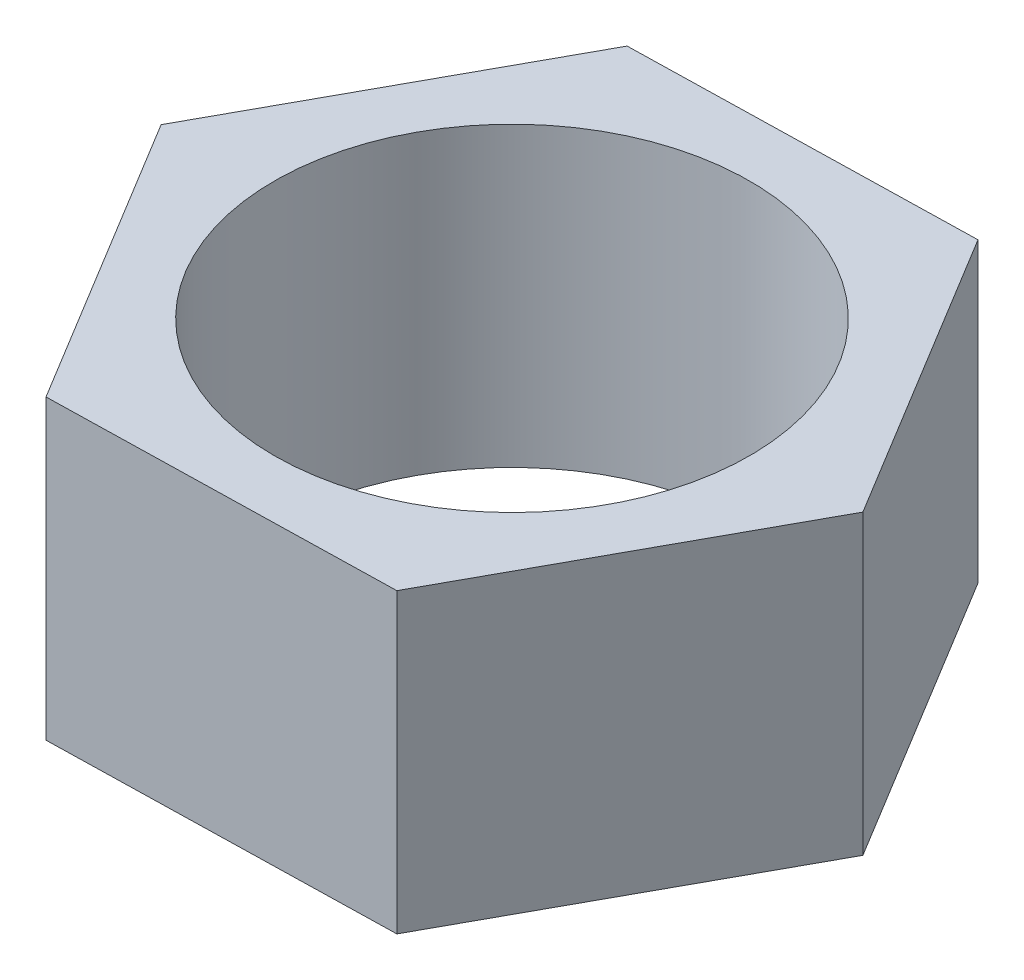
ISO-10303-21;
HEADER;
FILE_DESCRIPTION(('STEP AP214'),'2;1');
FILE_NAME('part.step','',(''),(''),'','','');
FILE_SCHEMA(('AUTOMOTIVE_DESIGN { 1 0 10303 214 1 1 1 1 }'));
ENDSEC;
DATA;
#1=APPLICATION_CONTEXT('core data for automotive mechanical design processes');
#2=APPLICATION_PROTOCOL_DEFINITION('international standard','automotive_design',2000,#1);
#3=PRODUCT_CONTEXT('',#1,'mechanical');
#4=PRODUCT('Part','Part','',(#3));
#5=PRODUCT_RELATED_PRODUCT_CATEGORY('part','',(#4));
#6=PRODUCT_DEFINITION_FORMATION('','',#4);
#7=PRODUCT_DEFINITION_CONTEXT('part definition',#1,'design');
#8=PRODUCT_DEFINITION('design','',#6,#7);
#9=PRODUCT_DEFINITION_SHAPE('','',#8);
#10=(LENGTH_UNIT() NAMED_UNIT(*) SI_UNIT(.MILLI.,.METRE.));
#11=(NAMED_UNIT(*) PLANE_ANGLE_UNIT() SI_UNIT($,.RADIAN.));
#12=(NAMED_UNIT(*) SI_UNIT($,.STERADIAN.) SOLID_ANGLE_UNIT());
#13=UNCERTAINTY_MEASURE_WITH_UNIT(LENGTH_MEASURE(1.E-05),#10,'distance_accuracy_value','');
#14=(GEOMETRIC_REPRESENTATION_CONTEXT(3) GLOBAL_UNCERTAINTY_ASSIGNED_CONTEXT((#13)) GLOBAL_UNIT_ASSIGNED_CONTEXT((#10,
#11,#12)) REPRESENTATION_CONTEXT('',''));
#15=CARTESIAN_POINT('',(0.,0.,0.));
#16=DIRECTION('',(0.,0.,1.));
#17=DIRECTION('',(1.,0.,0.));
#18=AXIS2_PLACEMENT_3D('',#15,#16,#17);
#19=CARTESIAN_POINT('',(-2.77410471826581,5.,5.06336610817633));
#20=DIRECTION('',(-0.0223846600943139,0.,-0.999749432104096));
#21=DIRECTION('',(-0.999749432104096,0.,0.0223846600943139));
#22=AXIS2_PLACEMENT_3D('',#19,#20,#21);
#23=PLANE('',#22);
#24=DIRECTION('',(0.999749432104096,0.,-0.0223846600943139));
#25=VECTOR('',#24,1.);
#26=CARTESIAN_POINT('',(-2.77410471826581,0.,5.06336610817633));
#27=LINE('',#26,#25);
#28=CARTESIAN_POINT('',(-2.77410471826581,0.,5.06336610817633));
#29=VERTEX_POINT('',#28);
#30=CARTESIAN_POINT('',(2.99795131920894,0.,4.93412821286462));
#31=VERTEX_POINT('',#30);
#32=EDGE_CURVE('E118',#29,#31,#27,.T.);
#33=ORIENTED_EDGE('',*,*,#32,.T.);
#34=DIRECTION('',(0.,-1.,0.));
#35=VECTOR('',#34,1.);
#36=CARTESIAN_POINT('',(2.99795131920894,5.,4.93412821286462));
#37=LINE('',#36,#35);
#38=CARTESIAN_POINT('',(2.99795131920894,5.,4.93412821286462));
#39=VERTEX_POINT('',#38);
#40=EDGE_CURVE('E11',#39,#31,#37,.T.);
#41=ORIENTED_EDGE('',*,*,#40,.F.);
#42=DIRECTION('',(0.999749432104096,0.,-0.0223846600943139));
#43=VECTOR('',#42,1.);
#44=CARTESIAN_POINT('',(-2.77410471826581,5.,5.06336610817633));
#45=LINE('',#44,#43);
#46=CARTESIAN_POINT('',(-2.77410471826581,5.,5.06336610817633));
#47=VERTEX_POINT('',#46);
#48=EDGE_CURVE('E128',#47,#39,#45,.T.);
#49=ORIENTED_EDGE('',*,*,#48,.F.);
#50=DIRECTION('',(0.,-1.,0.));
#51=VECTOR('',#50,1.);
#52=CARTESIAN_POINT('',(-2.77410471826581,5.,5.06336610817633));
#53=LINE('',#52,#51);
#54=EDGE_CURVE('E114',#47,#29,#53,.T.);
#55=ORIENTED_EDGE('',*,*,#54,.T.);
#56=EDGE_LOOP('',(#33,#41,#49,#55));
#57=FACE_BOUND('',#56,.T.);
#58=ADVANCED_FACE('F33',(#57),#23,.F.);
#59=CARTESIAN_POINT('',(2.99795131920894,5.,4.93412821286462));
#60=DIRECTION('',(-0.877000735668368,0.,-0.480489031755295));
#61=DIRECTION('',(-0.480489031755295,0.,0.877000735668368));
#62=AXIS2_PLACEMENT_3D('',#59,#60,#61);
#63=PLANE('',#62);
#64=DIRECTION('',(0.480489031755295,0.,-0.877000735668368));
#65=VECTOR('',#64,1.);
#66=CARTESIAN_POINT('',(2.99795131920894,0.,4.93412821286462));
#67=LINE('',#66,#65);
#68=CARTESIAN_POINT('',(5.77205603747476,0.,-0.129237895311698));
#69=VERTEX_POINT('',#68);
#70=EDGE_CURVE('E121',#31,#69,#67,.T.);
#71=ORIENTED_EDGE('',*,*,#70,.T.);
#72=DIRECTION('',(0.,-1.,0.));
#73=VECTOR('',#72,1.);
#74=CARTESIAN_POINT('',(5.77205603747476,5.,-0.129237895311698));
#75=LINE('',#74,#73);
#76=CARTESIAN_POINT('',(5.77205603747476,5.,-0.129237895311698));
#77=VERTEX_POINT('',#76);
#78=EDGE_CURVE('E42',#77,#69,#75,.T.);
#79=ORIENTED_EDGE('',*,*,#78,.F.);
#80=DIRECTION('',(0.480489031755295,0.,-0.877000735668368));
#81=VECTOR('',#80,1.);
#82=CARTESIAN_POINT('',(2.99795131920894,5.,4.93412821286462));
#83=LINE('',#82,#81);
#84=EDGE_CURVE('E87',#39,#77,#83,.T.);
#85=ORIENTED_EDGE('',*,*,#84,.F.);
#86=ORIENTED_EDGE('',*,*,#40,.T.);
#87=EDGE_LOOP('',(#71,#79,#85,#86));
#88=FACE_BOUND('',#87,.T.);
#89=ADVANCED_FACE('F154',(#88),#63,.F.);
#90=CARTESIAN_POINT('',(5.77205603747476,5.,-0.129237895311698));
#91=DIRECTION('',(-0.854616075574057,0.,0.519260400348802));
#92=DIRECTION('',(0.519260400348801,0.,0.854616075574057));
#93=AXIS2_PLACEMENT_3D('',#90,#91,#92);
#94=PLANE('',#93);
#95=DIRECTION('',(-0.519260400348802,0.,-0.854616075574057));
#96=VECTOR('',#95,1.);
#97=CARTESIAN_POINT('',(5.77205603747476,0.,-0.129237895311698));
#98=LINE('',#97,#96);
#99=CARTESIAN_POINT('',(2.77410471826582,0.,-5.06336610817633));
#100=VERTEX_POINT('',#99);
#101=EDGE_CURVE('E123',#69,#100,#98,.T.);
#102=ORIENTED_EDGE('',*,*,#101,.T.);
#103=DIRECTION('',(0.,-1.,0.));
#104=VECTOR('',#103,1.);
#105=CARTESIAN_POINT('',(2.77410471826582,5.,-5.06336610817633));
#106=LINE('',#105,#104);
#107=CARTESIAN_POINT('',(2.77410471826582,5.,-5.06336610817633));
#108=VERTEX_POINT('',#107);
#109=EDGE_CURVE('E109',#108,#100,#106,.T.);
#110=ORIENTED_EDGE('',*,*,#109,.F.);
#111=DIRECTION('',(-0.519260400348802,0.,-0.854616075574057));
#112=VECTOR('',#111,1.);
#113=CARTESIAN_POINT('',(5.77205603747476,5.,-0.129237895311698));
#114=LINE('',#113,#112);
#115=EDGE_CURVE('E100',#77,#108,#114,.T.);
#116=ORIENTED_EDGE('',*,*,#115,.F.);
#117=ORIENTED_EDGE('',*,*,#78,.T.);
#118=EDGE_LOOP('',(#102,#110,#116,#117));
#119=FACE_BOUND('',#118,.T.);
#120=ADVANCED_FACE('F135',(#119),#94,.F.);
#121=CARTESIAN_POINT('',(2.77410471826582,5.,-5.06336610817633));
#122=DIRECTION('',(0.0223846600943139,0.,0.999749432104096));
#123=DIRECTION('',(0.999749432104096,0.,-0.0223846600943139));
#124=AXIS2_PLACEMENT_3D('',#121,#122,#123);
#125=PLANE('',#124);
#126=DIRECTION('',(-0.999749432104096,0.,0.0223846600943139));
#127=VECTOR('',#126,1.);
#128=CARTESIAN_POINT('',(2.77410471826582,0.,-5.06336610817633));
#129=LINE('',#128,#127);
#130=CARTESIAN_POINT('',(-2.99795131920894,0.,-4.93412821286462));
#131=VERTEX_POINT('',#130);
#132=EDGE_CURVE('E108',#100,#131,#129,.T.);
#133=ORIENTED_EDGE('',*,*,#132,.T.);
#134=DIRECTION('',(0.,-1.,0.));
#135=VECTOR('',#134,1.);
#136=CARTESIAN_POINT('',(-2.99795131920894,5.,-4.93412821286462));
#137=LINE('',#136,#135);
#138=CARTESIAN_POINT('',(-2.99795131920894,5.,-4.93412821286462));
#139=VERTEX_POINT('',#138);
#140=EDGE_CURVE('E105',#139,#131,#137,.T.);
#141=ORIENTED_EDGE('',*,*,#140,.F.);
#142=DIRECTION('',(-0.999749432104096,0.,0.0223846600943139));
#143=VECTOR('',#142,1.);
#144=CARTESIAN_POINT('',(2.77410471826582,5.,-5.06336610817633));
#145=LINE('',#144,#143);
#146=EDGE_CURVE('E94',#108,#139,#145,.T.);
#147=ORIENTED_EDGE('',*,*,#146,.F.);
#148=ORIENTED_EDGE('',*,*,#109,.T.);
#149=EDGE_LOOP('',(#133,#141,#147,#148));
#150=FACE_BOUND('',#149,.T.);
#151=ADVANCED_FACE('F106',(#150),#125,.F.);
#152=CARTESIAN_POINT('',(-2.99795131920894,5.,-4.93412821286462));
#153=DIRECTION('',(0.877000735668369,0.,0.480489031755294));
#154=DIRECTION('',(0.480489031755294,0.,-0.877000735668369));
#155=AXIS2_PLACEMENT_3D('',#152,#153,#154);
#156=PLANE('',#155);
#157=DIRECTION('',(-0.480489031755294,0.,0.877000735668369));
#158=VECTOR('',#157,1.);
#159=CARTESIAN_POINT('',(-2.99795131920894,0.,-4.93412821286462));
#160=LINE('',#159,#158);
#161=CARTESIAN_POINT('',(-5.77205603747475,0.,0.129237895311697));
#162=VERTEX_POINT('',#161);
#163=EDGE_CURVE('E73',#131,#162,#160,.T.);
#164=ORIENTED_EDGE('',*,*,#163,.T.);
#165=DIRECTION('',(0.,-1.,0.));
#166=VECTOR('',#165,1.);
#167=CARTESIAN_POINT('',(-5.77205603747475,5.,0.129237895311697));
#168=LINE('',#167,#166);
#169=CARTESIAN_POINT('',(-5.77205603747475,5.,0.129237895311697));
#170=VERTEX_POINT('',#169);
#171=EDGE_CURVE('E110',#170,#162,#168,.T.);
#172=ORIENTED_EDGE('',*,*,#171,.F.);
#173=DIRECTION('',(-0.480489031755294,0.,0.877000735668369));
#174=VECTOR('',#173,1.);
#175=CARTESIAN_POINT('',(-2.99795131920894,5.,-4.93412821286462));
#176=LINE('',#175,#174);
#177=EDGE_CURVE('E98',#139,#170,#176,.T.);
#178=ORIENTED_EDGE('',*,*,#177,.F.);
#179=ORIENTED_EDGE('',*,*,#140,.T.);
#180=EDGE_LOOP('',(#164,#172,#178,#179));
#181=FACE_BOUND('',#180,.T.);
#182=ADVANCED_FACE('F112',(#181),#156,.F.);
#183=CARTESIAN_POINT('',(-5.77205603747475,5.,0.129237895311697));
#184=DIRECTION('',(0.854616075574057,0.,-0.519260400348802));
#185=DIRECTION('',(-0.519260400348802,0.,-0.854616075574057));
#186=AXIS2_PLACEMENT_3D('',#183,#184,#185);
#187=PLANE('',#186);
#188=DIRECTION('',(0.519260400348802,0.,0.854616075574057));
#189=VECTOR('',#188,1.);
#190=CARTESIAN_POINT('',(-5.77205603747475,0.,0.129237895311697));
#191=LINE('',#190,#189);
#192=EDGE_CURVE('E79',#162,#29,#191,.T.);
#193=ORIENTED_EDGE('',*,*,#192,.T.);
#194=ORIENTED_EDGE('',*,*,#54,.F.);
#195=DIRECTION('',(0.519260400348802,0.,0.854616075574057));
#196=VECTOR('',#195,1.);
#197=CARTESIAN_POINT('',(-5.77205603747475,5.,0.129237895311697));
#198=LINE('',#197,#196);
#199=EDGE_CURVE('E50',#170,#47,#198,.T.);
#200=ORIENTED_EDGE('',*,*,#199,.F.);
#201=ORIENTED_EDGE('',*,*,#171,.T.);
#202=EDGE_LOOP('',(#193,#194,#200,#201));
#203=FACE_BOUND('',#202,.T.);
#204=ADVANCED_FACE('F142',(#203),#187,.F.);
#205=CARTESIAN_POINT('',(0.,5.,0.));
#206=DIRECTION('',(0.,1.,0.));
#207=DIRECTION('',(0.,0.,1.));
#208=AXIS2_PLACEMENT_3D('',#205,#206,#207);
#209=PLANE('',#208);
#210=CARTESIAN_POINT('',(0.,5.,0.));
#211=DIRECTION('',(0.,1.,0.));
#212=DIRECTION('',(0.,0.,1.));
#213=AXIS2_PLACEMENT_3D('',#210,#211,#212);
#214=CIRCLE('',#213,4.);
#215=CARTESIAN_POINT('',(0.,5.,4.));
#216=VERTEX_POINT('',#215);
#217=EDGE_CURVE('E207',#216,#216,#214,.T.);
#218=ORIENTED_EDGE('',*,*,#217,.F.);
#219=EDGE_LOOP('',(#218));
#220=FACE_BOUND('',#219,.T.);
#221=ORIENTED_EDGE('',*,*,#48,.T.);
#222=ORIENTED_EDGE('',*,*,#84,.T.);
#223=ORIENTED_EDGE('',*,*,#115,.T.);
#224=ORIENTED_EDGE('',*,*,#146,.T.);
#225=ORIENTED_EDGE('',*,*,#177,.T.);
#226=ORIENTED_EDGE('',*,*,#199,.T.);
#227=EDGE_LOOP('',(#221,#222,#223,#224,#225,#226));
#228=FACE_BOUND('',#227,.T.);
#229=ADVANCED_FACE('F96',(#220,#228),#209,.T.);
#230=CARTESIAN_POINT('',(0.,0.,0.));
#231=DIRECTION('',(0.,1.,0.));
#232=DIRECTION('',(0.,0.,1.));
#233=AXIS2_PLACEMENT_3D('',#230,#231,#232);
#234=PLANE('',#233);
#235=CARTESIAN_POINT('',(0.,0.,0.));
#236=DIRECTION('',(0.,1.,0.));
#237=DIRECTION('',(0.,0.,1.));
#238=AXIS2_PLACEMENT_3D('',#235,#236,#237);
#239=CIRCLE('',#238,4.);
#240=CARTESIAN_POINT('',(0.,0.,4.));
#241=VERTEX_POINT('',#240);
#242=EDGE_CURVE('E36',#241,#241,#239,.T.);
#243=ORIENTED_EDGE('',*,*,#242,.T.);
#244=EDGE_LOOP('',(#243));
#245=FACE_BOUND('',#244,.T.);
#246=ORIENTED_EDGE('',*,*,#32,.F.);
#247=ORIENTED_EDGE('',*,*,#192,.F.);
#248=ORIENTED_EDGE('',*,*,#163,.F.);
#249=ORIENTED_EDGE('',*,*,#132,.F.);
#250=ORIENTED_EDGE('',*,*,#101,.F.);
#251=ORIENTED_EDGE('',*,*,#70,.F.);
#252=EDGE_LOOP('',(#246,#247,#248,#249,#250,#251));
#253=FACE_BOUND('',#252,.T.);
#254=ADVANCED_FACE('F138',(#245,#253),#234,.F.);
#255=CARTESIAN_POINT('',(0.,-9.,0.));
#256=DIRECTION('',(0.,1.,0.));
#257=DIRECTION('',(0.,0.,1.));
#258=AXIS2_PLACEMENT_3D('',#255,#256,#257);
#259=CYLINDRICAL_SURFACE('',#258,4.);
#260=ORIENTED_EDGE('',*,*,#217,.T.);
#261=EDGE_LOOP('',(#260));
#262=FACE_BOUND('',#261,.T.);
#263=ORIENTED_EDGE('',*,*,#242,.F.);
#264=EDGE_LOOP('',(#263));
#265=FACE_BOUND('',#264,.T.);
#266=ADVANCED_FACE('F191',(#262,#265),#259,.F.);
#267=CLOSED_SHELL('',(#58,#89,#120,#151,#182,#204,#229,#254,#266));
#268=MANIFOLD_SOLID_BREP('B2',#267);
#269=ADVANCED_BREP_SHAPE_REPRESENTATION('',(#18,#268),#14);
#270=SHAPE_DEFINITION_REPRESENTATION(#9,#269);
ENDSEC;
END-ISO-10303-21;
